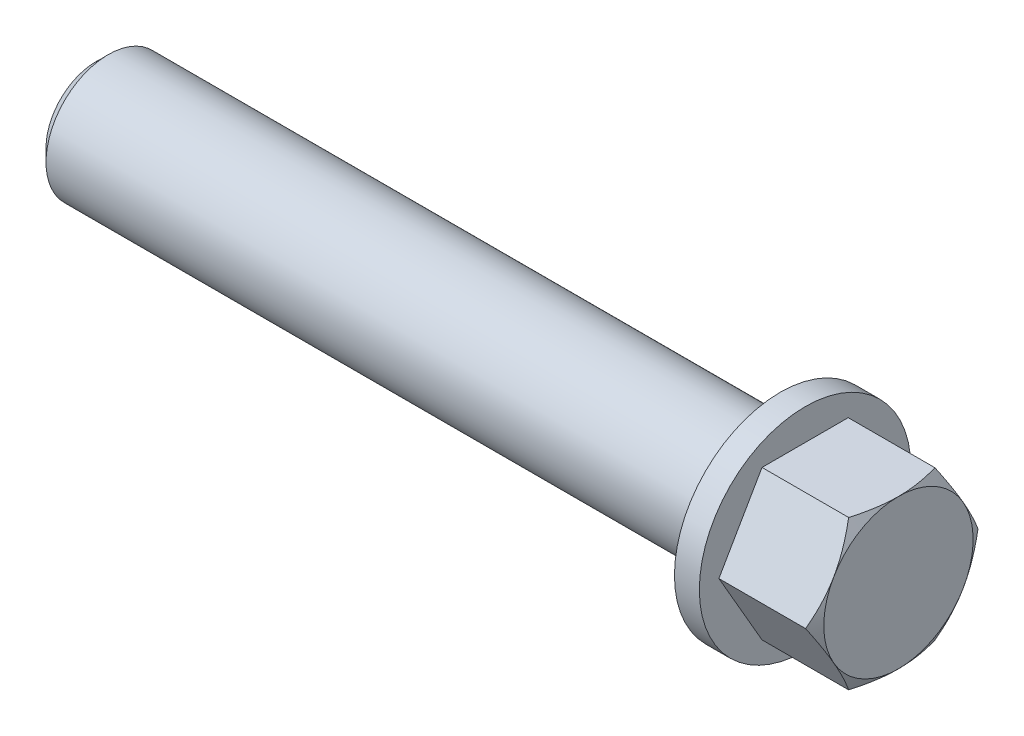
ISO-10303-21;
HEADER;
FILE_DESCRIPTION(('STEP AP214'),'2;1');
FILE_NAME('part.step','',(''),(''),'','','');
FILE_SCHEMA(('AUTOMOTIVE_DESIGN { 1 0 10303 214 1 1 1 1 }'));
ENDSEC;
DATA;
#1=APPLICATION_CONTEXT('core data for automotive mechanical design processes');
#2=APPLICATION_PROTOCOL_DEFINITION('international standard','automotive_design',2000,#1);
#3=PRODUCT_CONTEXT('',#1,'mechanical');
#4=PRODUCT('Part','Part','',(#3));
#5=PRODUCT_RELATED_PRODUCT_CATEGORY('part','',(#4));
#6=PRODUCT_DEFINITION_FORMATION('','',#4);
#7=PRODUCT_DEFINITION_CONTEXT('part definition',#1,'design');
#8=PRODUCT_DEFINITION('design','',#6,#7);
#9=PRODUCT_DEFINITION_SHAPE('','',#8);
#10=(LENGTH_UNIT() NAMED_UNIT(*) SI_UNIT(.MILLI.,.METRE.));
#11=(NAMED_UNIT(*) PLANE_ANGLE_UNIT() SI_UNIT($,.RADIAN.));
#12=(NAMED_UNIT(*) SI_UNIT($,.STERADIAN.) SOLID_ANGLE_UNIT());
#13=UNCERTAINTY_MEASURE_WITH_UNIT(LENGTH_MEASURE(1.E-05),#10,'distance_accuracy_value','');
#14=(GEOMETRIC_REPRESENTATION_CONTEXT(3) GLOBAL_UNCERTAINTY_ASSIGNED_CONTEXT((#13)) GLOBAL_UNIT_ASSIGNED_CONTEXT((#10,
#11,#12)) REPRESENTATION_CONTEXT('',''));
#15=CARTESIAN_POINT('',(0.,0.,0.));
#16=DIRECTION('',(0.,0.,1.));
#17=DIRECTION('',(1.,0.,0.));
#18=AXIS2_PLACEMENT_3D('',#15,#16,#17);
#19=CARTESIAN_POINT('',(7.5,-6.,-3.46410161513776));
#20=DIRECTION('',(0.,0.5,0.866025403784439));
#21=DIRECTION('',(0.,-0.866025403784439,0.5));
#22=AXIS2_PLACEMENT_3D('',#19,#20,#21);
#23=PLANE('',#22);
#24=DIRECTION('',(-1.,0.,0.));
#25=VECTOR('',#24,1.);
#26=CARTESIAN_POINT('',(7.5,0.,-6.92820323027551));
#27=LINE('',#26,#25);
#28=CARTESIAN_POINT('',(6.96410161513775,0.,-6.92820323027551));
#29=VERTEX_POINT('',#28);
#30=CARTESIAN_POINT('',(0.,0.,-6.92820323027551));
#31=VERTEX_POINT('',#30);
#32=EDGE_CURVE('E145',#29,#31,#27,.T.);
#33=ORIENTED_EDGE('',*,*,#32,.F.);
#34=CARTESIAN_POINT('',(6.96403494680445,0.0002,-6.92831870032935));
#35=CARTESIAN_POINT('',(7.00799100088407,-0.131687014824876,-6.85217369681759));
#36=CARTESIAN_POINT('',(7.0499521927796,-0.264065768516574,-6.7757447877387));
#37=CARTESIAN_POINT('',(7.12933542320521,-0.52989833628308,-6.62226628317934));
#38=CARTESIAN_POINT('',(7.16675550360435,-0.663352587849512,-6.54521643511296));
#39=CARTESIAN_POINT('',(7.27146958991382,-1.06585213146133,-6.31283321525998));
#40=CARTESIAN_POINT('',(7.33102994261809,-1.33648623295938,-6.15658254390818));
#41=CARTESIAN_POINT('',(7.40087178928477,-1.74148524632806,-5.92275625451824));
#42=CARTESIAN_POINT('',(7.42076777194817,-1.87464004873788,-5.84587929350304));
#43=CARTESIAN_POINT('',(7.45413058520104,-2.14155132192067,-5.69177799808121));
#44=CARTESIAN_POINT('',(7.46759798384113,-2.27530773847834,-5.6145536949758));
#45=CARTESIAN_POINT('',(7.48776040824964,-2.54305288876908,-5.45997096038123));
#46=CARTESIAN_POINT('',(7.49446312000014,-2.67704118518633,-5.38261278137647));
#47=CARTESIAN_POINT('',(7.50095963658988,-2.94513416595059,-5.22782922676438));
#48=CARTESIAN_POINT('',(7.50075365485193,-3.07923884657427,-5.1504038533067));
#49=CARTESIAN_POINT('',(7.49069281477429,-3.44664501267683,-4.93828180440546));
#50=CARTESIAN_POINT('',(7.47380210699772,-3.6798262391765,-4.80365456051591));
#51=CARTESIAN_POINT('',(7.42024077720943,-4.14463991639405,-4.53529425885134));
#52=CARTESIAN_POINT('',(7.38355184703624,-4.3762707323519,-4.40156214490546));
#53=CARTESIAN_POINT('',(7.2918398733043,-4.84201989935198,-4.13266173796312));
#54=CARTESIAN_POINT('',(7.23642824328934,-5.07607947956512,-3.99752737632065));
#55=CARTESIAN_POINT('',(7.11066608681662,-5.54070808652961,-3.7292739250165));
#56=CARTESIAN_POINT('',(7.04034510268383,-5.77128306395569,-3.59615139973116));
#57=CARTESIAN_POINT('',(6.96403494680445,-6.0002,-3.46398614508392));
#58=B_SPLINE_CURVE_WITH_KNOTS('',3,(#34,#35,#36,#37,#38,#39,#40,#41,#42,#43,#44,#45,#46,#47,#48,
#49,#50,#51,#52,#53,#54,#55,#56,#57),.UNSPECIFIED.,.F.,.F.,(4,2,2,2,2,2,2,2,2,2,2,4),(0.,
0.475482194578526,0.951168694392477,1.90451835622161,2.36951738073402,2.83447530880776,
3.29890435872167,3.76331906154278,4.57182194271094,5.38107376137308,6.20827406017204,
7.03385036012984),.UNSPECIFIED.);
#59=CARTESIAN_POINT('',(7.5,-3.,-5.19615242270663));
#60=VERTEX_POINT('',#59);
#61=EDGE_CURVE('E228',#29,#60,#58,.T.);
#62=ORIENTED_EDGE('',*,*,#61,.T.);
#63=CARTESIAN_POINT('',(6.96410161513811,-6.,-3.46410161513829));
#64=VERTEX_POINT('',#63);
#65=EDGE_CURVE('E230',#60,#64,#58,.T.);
#66=ORIENTED_EDGE('',*,*,#65,.T.);
#67=DIRECTION('',(-1.,0.,0.));
#68=VECTOR('',#67,1.);
#69=CARTESIAN_POINT('',(7.5,-6.,-3.46410161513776));
#70=LINE('',#69,#68);
#71=CARTESIAN_POINT('',(0.,-6.,-3.46410161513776));
#72=VERTEX_POINT('',#71);
#73=EDGE_CURVE('E117',#64,#72,#70,.T.);
#74=ORIENTED_EDGE('',*,*,#73,.T.);
#75=DIRECTION('',(0.,0.866025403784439,-0.5));
#76=VECTOR('',#75,1.);
#77=CARTESIAN_POINT('',(0.,-6.,-3.46410161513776));
#78=LINE('',#77,#76);
#79=EDGE_CURVE('E113',#72,#31,#78,.T.);
#80=ORIENTED_EDGE('',*,*,#79,.T.);
#81=EDGE_LOOP('',(#33,#62,#66,#74,#80));
#82=FACE_BOUND('',#81,.T.);
#83=ADVANCED_FACE('F36',(#82),#23,.F.);
#84=CARTESIAN_POINT('',(7.5,0.,-6.92820323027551));
#85=DIRECTION('',(0.,-0.5,0.866025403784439));
#86=DIRECTION('',(0.,-0.866025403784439,-0.5));
#87=AXIS2_PLACEMENT_3D('',#84,#85,#86);
#88=PLANE('',#87);
#89=DIRECTION('',(-1.,0.,0.));
#90=VECTOR('',#89,1.);
#91=CARTESIAN_POINT('',(7.5,6.,-3.46410161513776));
#92=LINE('',#91,#90);
#93=CARTESIAN_POINT('',(6.96410161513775,6.,-3.46410161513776));
#94=VERTEX_POINT('',#93);
#95=CARTESIAN_POINT('',(0.,6.,-3.46410161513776));
#96=VERTEX_POINT('',#95);
#97=EDGE_CURVE('E142',#94,#96,#92,.T.);
#98=ORIENTED_EDGE('',*,*,#97,.F.);
#99=CARTESIAN_POINT('',(6.96403494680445,6.0002,-3.46398614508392));
#100=CARTESIAN_POINT('',(7.00799100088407,5.86831298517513,-3.54013114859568));
#101=CARTESIAN_POINT('',(7.0499521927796,5.73593423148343,-3.61656005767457));
#102=CARTESIAN_POINT('',(7.12933542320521,5.47010166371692,-3.77003856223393));
#103=CARTESIAN_POINT('',(7.16675550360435,5.33664741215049,-3.84708841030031));
#104=CARTESIAN_POINT('',(7.27146958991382,4.93414786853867,-4.07947163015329));
#105=CARTESIAN_POINT('',(7.33102994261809,4.66351376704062,-4.23572230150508));
#106=CARTESIAN_POINT('',(7.40087178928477,4.25851475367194,-4.46954859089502));
#107=CARTESIAN_POINT('',(7.42076777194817,4.12535995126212,-4.54642555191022));
#108=CARTESIAN_POINT('',(7.45413058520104,3.85844867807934,-4.70052684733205));
#109=CARTESIAN_POINT('',(7.46759798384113,3.72469226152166,-4.77775115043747));
#110=CARTESIAN_POINT('',(7.48776040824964,3.45694711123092,-4.93233388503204));
#111=CARTESIAN_POINT('',(7.49446312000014,3.32295881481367,-5.0096920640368));
#112=CARTESIAN_POINT('',(7.50095963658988,3.05486583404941,-5.16447561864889));
#113=CARTESIAN_POINT('',(7.50075365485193,2.92076115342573,-5.24190099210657));
#114=CARTESIAN_POINT('',(7.49069281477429,2.55335498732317,-5.45402304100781));
#115=CARTESIAN_POINT('',(7.47380210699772,2.3201737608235,-5.58865028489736));
#116=CARTESIAN_POINT('',(7.42024077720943,1.85536008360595,-5.85701058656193));
#117=CARTESIAN_POINT('',(7.38355184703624,1.6237292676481,-5.99074270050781));
#118=CARTESIAN_POINT('',(7.2918398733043,1.15798010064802,-6.25964310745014));
#119=CARTESIAN_POINT('',(7.23642824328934,0.923920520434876,-6.39477746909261));
#120=CARTESIAN_POINT('',(7.11066608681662,0.45929191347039,-6.66303092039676));
#121=CARTESIAN_POINT('',(7.04034510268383,0.228716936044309,-6.7961534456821));
#122=CARTESIAN_POINT('',(6.96403494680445,-0.0001999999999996,-6.92831870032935));
#123=B_SPLINE_CURVE_WITH_KNOTS('',3,(#99,#100,#101,#102,#103,#104,#105,#106,#107,#108,#109,#110,
#111,#112,#113,#114,#115,#116,#117,#118,#119,#120,#121,#122),.UNSPECIFIED.,.F.,.F.,(4,2,2,2,2,2,
2,2,2,2,2,4),(0.,0.475482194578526,0.951168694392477,1.90451835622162,2.36951738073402,
2.83447530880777,3.29890435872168,3.76331906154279,4.57182194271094,5.38107376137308,
6.20827406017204,7.03385036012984),.UNSPECIFIED.);
#124=CARTESIAN_POINT('',(7.5,3.,-5.19615242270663));
#125=VERTEX_POINT('',#124);
#126=EDGE_CURVE('E219',#94,#125,#123,.T.);
#127=ORIENTED_EDGE('',*,*,#126,.T.);
#128=EDGE_CURVE('E193',#125,#29,#123,.T.);
#129=ORIENTED_EDGE('',*,*,#128,.T.);
#130=ORIENTED_EDGE('',*,*,#32,.T.);
#131=DIRECTION('',(0.,0.866025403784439,0.5));
#132=VECTOR('',#131,1.);
#133=CARTESIAN_POINT('',(0.,0.,-6.92820323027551));
#134=LINE('',#133,#132);
#135=EDGE_CURVE('E184',#31,#96,#134,.T.);
#136=ORIENTED_EDGE('',*,*,#135,.T.);
#137=EDGE_LOOP('',(#98,#127,#129,#130,#136));
#138=FACE_BOUND('',#137,.T.);
#139=ADVANCED_FACE('F207',(#138),#88,.F.);
#140=CARTESIAN_POINT('',(7.5,6.,-3.46410161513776));
#141=DIRECTION('',(0.,-1.,0.));
#142=DIRECTION('',(0.,0.,-1.));
#143=AXIS2_PLACEMENT_3D('',#140,#141,#142);
#144=PLANE('',#143);
#145=DIRECTION('',(-1.,0.,0.));
#146=VECTOR('',#145,1.);
#147=CARTESIAN_POINT('',(7.5,6.,3.46410161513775));
#148=LINE('',#147,#146);
#149=CARTESIAN_POINT('',(6.96410161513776,6.,3.46410161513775));
#150=VERTEX_POINT('',#149);
#151=CARTESIAN_POINT('',(0.,6.,3.46410161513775));
#152=VERTEX_POINT('',#151);
#153=EDGE_CURVE('E139',#150,#152,#148,.T.);
#154=ORIENTED_EDGE('',*,*,#153,.F.);
#155=CARTESIAN_POINT('',(4.53815459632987,6.00000000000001,-9.37434719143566));
#156=CARTESIAN_POINT('',(4.66588950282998,6.,-9.11159664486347));
#157=CARTESIAN_POINT('',(4.79241913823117,6.,-8.84825012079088));
#158=CARTESIAN_POINT('',(5.04239100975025,6.,-8.32004824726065));
#159=CARTESIAN_POINT('',(5.16583277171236,6.,-8.05519267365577));
#160=CARTESIAN_POINT('',(5.4095577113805,6.,-7.52232548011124));
#161=CARTESIAN_POINT('',(5.52982064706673,6.,-7.25430457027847));
#162=CARTESIAN_POINT('',(5.7655135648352,6.,-6.71615392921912));
#163=CARTESIAN_POINT('',(5.88094377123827,6.,-6.44602429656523));
#164=CARTESIAN_POINT('',(6.10932867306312,6.,-5.89445558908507));
#165=CARTESIAN_POINT('',(6.22208293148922,6.,-5.61293307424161));
#166=CARTESIAN_POINT('',(6.43922432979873,6.,-5.04662051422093));
#167=CARTESIAN_POINT('',(6.5436105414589,6.,-4.76183011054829));
#168=CARTESIAN_POINT('',(6.7413280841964,6.,-4.18903963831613));
#169=CARTESIAN_POINT('',(6.83468115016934,6.,-3.90104714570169));
#170=CARTESIAN_POINT('',(7.00738274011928,6.,-3.32092961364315));
#171=CARTESIAN_POINT('',(7.08673559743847,6.,-3.02880588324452));
#172=CARTESIAN_POINT('',(7.22727999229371,6.,-2.44180312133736));
#173=CARTESIAN_POINT('',(7.2885662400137,6.,-2.14694713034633));
#174=CARTESIAN_POINT('',(7.38951072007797,6.,-1.55345729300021));
#175=CARTESIAN_POINT('',(7.42917131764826,6.,-1.2548238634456));
#176=CARTESIAN_POINT('',(7.46981310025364,6.,-0.807215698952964));
#177=CARTESIAN_POINT('',(7.48021070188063,6.,-0.659059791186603));
#178=CARTESIAN_POINT('',(7.49473309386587,6.,-0.36243435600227));
#179=CARTESIAN_POINT('',(7.49885799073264,6.,-0.213964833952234));
#180=CARTESIAN_POINT('',(7.50072952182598,6.,0.0830171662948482));
#181=CARTESIAN_POINT('',(7.49847601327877,6.,0.23152964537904));
#182=CARTESIAN_POINT('',(7.48764825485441,6.,0.528326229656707));
#183=CARTESIAN_POINT('',(7.47907370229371,6.,0.676610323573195));
#184=CARTESIAN_POINT('',(7.4512311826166,6.,1.0307338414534));
#185=CARTESIAN_POINT('',(7.42908921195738,6.,1.23635220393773));
#186=CARTESIAN_POINT('',(7.37384140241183,6.,1.64609980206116));
#187=CARTESIAN_POINT('',(7.34073414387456,6.,1.85022884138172));
#188=CARTESIAN_POINT('',(7.22671763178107,6.,2.46011094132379));
#189=CARTESIAN_POINT('',(7.13113151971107,6.,2.8631585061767));
#190=CARTESIAN_POINT('',(6.96482537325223,6.,3.46624827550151));
#191=CARTESIAN_POINT('',(6.90472502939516,6.,3.66939855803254));
#192=CARTESIAN_POINT('',(6.77815690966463,6.,4.07372546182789));
#193=CARTESIAN_POINT('',(6.71168908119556,5.99999999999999,4.27490206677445));
#194=CARTESIAN_POINT('',(6.57346306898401,5.99999999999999,4.6753490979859));
#195=CARTESIAN_POINT('',(6.50170638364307,5.99999999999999,4.87462004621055));
#196=CARTESIAN_POINT('',(6.35375957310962,5.99999999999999,5.27149669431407));
#197=CARTESIAN_POINT('',(6.2775695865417,5.99999999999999,5.4691024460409));
#198=CARTESIAN_POINT('',(6.04601415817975,5.99999999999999,6.0532941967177));
#199=CARTESIAN_POINT('',(5.88535342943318,5.99999999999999,6.43778007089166));
#200=CARTESIAN_POINT('',(5.5539041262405,5.99999999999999,7.20237916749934));
#201=CARTESIAN_POINT('',(5.38311401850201,5.99999999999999,7.58249171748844));
#202=CARTESIAN_POINT('',(5.03408337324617,5.99999999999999,8.33949830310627));
#203=CARTESIAN_POINT('',(4.85583916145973,5.99999999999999,8.71639063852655));
#204=CARTESIAN_POINT('',(4.49388903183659,5.99999999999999,9.46750615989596));
#205=CARTESIAN_POINT('',(4.31018343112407,5.99999999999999,9.84172949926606));
#206=CARTESIAN_POINT('',(3.93826406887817,5.99999999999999,10.5888150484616));
#207=CARTESIAN_POINT('',(3.7500423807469,5.99999999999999,10.9616733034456));
#208=CARTESIAN_POINT('',(3.3703714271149,5.99999999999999,11.7057456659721));
#209=CARTESIAN_POINT('',(3.17892212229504,5.99999999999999,12.0769597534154));
#210=CARTESIAN_POINT('',(2.79354033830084,5.99999999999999,12.8179592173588));
#211=CARTESIAN_POINT('',(2.59960859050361,5.99999999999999,13.1877449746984));
#212=CARTESIAN_POINT('',(2.20971236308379,5.99999999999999,13.9262438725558));
#213=CARTESIAN_POINT('',(2.01374787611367,5.99999999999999,14.2949570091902));
#214=CARTESIAN_POINT('',(1.4714953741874,5.99999999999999,15.3097665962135));
#215=CARTESIAN_POINT('',(1.12350140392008,5.99999999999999,15.9549512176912));
#216=CARTESIAN_POINT('',(0.423895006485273,5.99999999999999,17.2434201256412));
#217=CARTESIAN_POINT('',(0.0722822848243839,5.99999999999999,17.8867042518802));
#218=CARTESIAN_POINT('',(-0.63227161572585,5.99999999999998,19.1694209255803));
#219=CARTESIAN_POINT('',(-0.985202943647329,5.99999999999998,19.8088588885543));
#220=CARTESIAN_POINT('',(-1.69305970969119,5.99999999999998,21.0865502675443));
#221=CARTESIAN_POINT('',(-2.04798495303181,5.99999999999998,21.7248037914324));
#222=CARTESIAN_POINT('',(-2.40362541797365,5.99999999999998,22.3626558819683));
#223=B_SPLINE_CURVE_WITH_KNOTS('',3,(#155,#156,#157,#158,#159,#160,#161,#162,#163,#164,#165,
#166,#167,#168,#169,#170,#171,#172,#173,#174,#175,#176,#177,#178,#179,#180,#181,#182,#183,#184,
#185,#186,#187,#188,#189,#190,#191,#192,#193,#194,#195,#196,#197,#198,#199,#200,#201,#202,#203,
#204,#205,#206,#207,#208,#209,#210,#211,#212,#213,#214,#215,#216,#217,#218,#219,#220,#221,#222),
.UNSPECIFIED.,.F.,.F.,(4,2,2,2,2,2,2,2,2,2,2,2,2,2,2,2,2,2,2,2,2,2,2,2,2,2,2,2,2,2,2,2,2,4),(0.,
0.876472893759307,1.75307955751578,2.63433891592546,3.51555732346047,4.42524359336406,
5.33503063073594,6.24299444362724,7.15067672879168,8.05351243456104,8.95624937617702,
9.40169771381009,9.84713848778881,10.292589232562,10.7380613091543,11.3581343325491,
11.9782876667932,13.2191954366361,13.8547020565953,14.4902139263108,15.1255464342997,
15.7608590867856,17.0107329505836,18.260796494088,19.5114836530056,20.7620983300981,
22.0150971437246,23.2681112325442,24.5207642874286,25.7734218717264,27.9725551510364,
30.1718688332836,32.3629769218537,34.5538745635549),.UNSPECIFIED.);
#224=CARTESIAN_POINT('',(7.5,6.,0.));
#225=VERTEX_POINT('',#224);
#226=EDGE_CURVE('E176',#150,#225,#223,.F.);
#227=ORIENTED_EDGE('',*,*,#226,.T.);
#228=EDGE_CURVE('E178',#225,#94,#223,.F.);
#229=ORIENTED_EDGE('',*,*,#228,.T.);
#230=ORIENTED_EDGE('',*,*,#97,.T.);
#231=DIRECTION('',(0.,0.,1.));
#232=VECTOR('',#231,1.);
#233=CARTESIAN_POINT('',(0.,6.,-3.46410161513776));
#234=LINE('',#233,#232);
#235=EDGE_CURVE('E133',#96,#152,#234,.T.);
#236=ORIENTED_EDGE('',*,*,#235,.T.);
#237=EDGE_LOOP('',(#154,#227,#229,#230,#236));
#238=FACE_BOUND('',#237,.T.);
#239=ADVANCED_FACE('F177',(#238),#144,.F.);
#240=CARTESIAN_POINT('',(7.5,6.,3.46410161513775));
#241=DIRECTION('',(0.,-0.5,-0.866025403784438));
#242=DIRECTION('',(0.,0.866025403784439,-0.5));
#243=AXIS2_PLACEMENT_3D('',#240,#241,#242);
#244=PLANE('',#243);
#245=DIRECTION('',(-1.,0.,0.));
#246=VECTOR('',#245,1.);
#247=CARTESIAN_POINT('',(7.5,0.,6.92820323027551));
#248=LINE('',#247,#246);
#249=CARTESIAN_POINT('',(6.96410161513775,0.,6.92820323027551));
#250=VERTEX_POINT('',#249);
#251=CARTESIAN_POINT('',(0.,0.,6.92820323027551));
#252=VERTEX_POINT('',#251);
#253=EDGE_CURVE('E125',#250,#252,#248,.T.);
#254=ORIENTED_EDGE('',*,*,#253,.F.);
#255=CARTESIAN_POINT('',(6.96403494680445,-0.000200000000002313,6.92831870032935));
#256=CARTESIAN_POINT('',(7.00799100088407,0.131687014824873,6.85217369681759));
#257=CARTESIAN_POINT('',(7.0499521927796,0.264065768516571,6.7757447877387));
#258=CARTESIAN_POINT('',(7.12933542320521,0.529898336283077,6.62226628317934));
#259=CARTESIAN_POINT('',(7.16675550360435,0.663352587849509,6.54521643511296));
#260=CARTESIAN_POINT('',(7.27146958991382,1.06585213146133,6.31283321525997));
#261=CARTESIAN_POINT('',(7.3310299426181,1.33648623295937,6.15658254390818));
#262=CARTESIAN_POINT('',(7.40087178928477,1.74148524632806,5.92275625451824));
#263=CARTESIAN_POINT('',(7.42076777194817,1.87464004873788,5.84587929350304));
#264=CARTESIAN_POINT('',(7.45413058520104,2.14155132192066,5.69177799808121));
#265=CARTESIAN_POINT('',(7.46759798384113,2.27530773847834,5.6145536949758));
#266=CARTESIAN_POINT('',(7.48776040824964,2.54305288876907,5.45997096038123));
#267=CARTESIAN_POINT('',(7.49446312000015,2.67704118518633,5.38261278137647));
#268=CARTESIAN_POINT('',(7.50095963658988,2.94513416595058,5.22782922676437));
#269=CARTESIAN_POINT('',(7.50075365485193,3.07923884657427,5.1504038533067));
#270=CARTESIAN_POINT('',(7.49069281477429,3.44664501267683,4.93828180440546));
#271=CARTESIAN_POINT('',(7.47380210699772,3.6798262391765,4.80365456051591));
#272=CARTESIAN_POINT('',(7.42024077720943,4.14463991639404,4.53529425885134));
#273=CARTESIAN_POINT('',(7.38355184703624,4.3762707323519,4.40156214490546));
#274=CARTESIAN_POINT('',(7.2918398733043,4.84201989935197,4.13266173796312));
#275=CARTESIAN_POINT('',(7.23642824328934,5.07607947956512,3.99752737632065));
#276=CARTESIAN_POINT('',(7.11066608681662,5.54070808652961,3.7292739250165));
#277=CARTESIAN_POINT('',(7.04034510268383,5.77128306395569,3.59615139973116));
#278=CARTESIAN_POINT('',(6.96403494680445,6.0002,3.46398614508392));
#279=B_SPLINE_CURVE_WITH_KNOTS('',3,(#255,#256,#257,#258,#259,#260,#261,#262,#263,#264,#265,
#266,#267,#268,#269,#270,#271,#272,#273,#274,#275,#276,#277,#278),.UNSPECIFIED.,.F.,.F.,(4,2,2,
2,2,2,2,2,2,2,2,4),(0.,0.475482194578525,0.951168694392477,1.90451835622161,2.36951738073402,
2.83447530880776,3.29890435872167,3.76331906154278,4.57182194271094,5.38107376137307,
6.20827406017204,7.03385036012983),.UNSPECIFIED.);
#280=CARTESIAN_POINT('',(7.5,3.,5.19615242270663));
#281=VERTEX_POINT('',#280);
#282=EDGE_CURVE('E221',#250,#281,#279,.T.);
#283=ORIENTED_EDGE('',*,*,#282,.T.);
#284=EDGE_CURVE('E186',#281,#150,#279,.T.);
#285=ORIENTED_EDGE('',*,*,#284,.T.);
#286=ORIENTED_EDGE('',*,*,#153,.T.);
#287=DIRECTION('',(0.,-0.866025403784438,0.5));
#288=VECTOR('',#287,1.);
#289=CARTESIAN_POINT('',(0.,6.,3.46410161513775));
#290=LINE('',#289,#288);
#291=EDGE_CURVE('E131',#152,#252,#290,.T.);
#292=ORIENTED_EDGE('',*,*,#291,.T.);
#293=EDGE_LOOP('',(#254,#283,#285,#286,#292));
#294=FACE_BOUND('',#293,.T.);
#295=ADVANCED_FACE('F206',(#294),#244,.F.);
#296=CARTESIAN_POINT('',(7.5,0.,6.92820323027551));
#297=DIRECTION('',(0.,0.5,-0.866025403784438));
#298=DIRECTION('',(0.,0.866025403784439,0.5));
#299=AXIS2_PLACEMENT_3D('',#296,#297,#298);
#300=PLANE('',#299);
#301=DIRECTION('',(-1.,0.,0.));
#302=VECTOR('',#301,1.);
#303=CARTESIAN_POINT('',(7.5,-6.,3.46410161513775));
#304=LINE('',#303,#302);
#305=CARTESIAN_POINT('',(6.96410161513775,-6.,3.46410161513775));
#306=VERTEX_POINT('',#305);
#307=CARTESIAN_POINT('',(0.,-6.,3.46410161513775));
#308=VERTEX_POINT('',#307);
#309=EDGE_CURVE('E120',#306,#308,#304,.T.);
#310=ORIENTED_EDGE('',*,*,#309,.F.);
#311=CARTESIAN_POINT('',(6.96403494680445,-6.0002,3.46398614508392));
#312=CARTESIAN_POINT('',(7.00799100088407,-5.86831298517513,3.54013114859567));
#313=CARTESIAN_POINT('',(7.0499521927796,-5.73593423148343,3.61656005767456));
#314=CARTESIAN_POINT('',(7.12933542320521,-5.47010166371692,3.77003856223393));
#315=CARTESIAN_POINT('',(7.16675550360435,-5.33664741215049,3.8470884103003));
#316=CARTESIAN_POINT('',(7.27146958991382,-4.93414786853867,4.07947163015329));
#317=CARTESIAN_POINT('',(7.33102994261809,-4.66351376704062,4.23572230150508));
#318=CARTESIAN_POINT('',(7.40087178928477,-4.25851475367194,4.46954859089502));
#319=CARTESIAN_POINT('',(7.42076777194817,-4.12535995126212,4.54642555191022));
#320=CARTESIAN_POINT('',(7.45413058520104,-3.85844867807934,4.70052684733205));
#321=CARTESIAN_POINT('',(7.46759798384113,-3.72469226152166,4.77775115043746));
#322=CARTESIAN_POINT('',(7.48776040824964,-3.45694711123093,4.93233388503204));
#323=CARTESIAN_POINT('',(7.49446312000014,-3.32295881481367,5.0096920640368));
#324=CARTESIAN_POINT('',(7.50095963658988,-3.05486583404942,5.16447561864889));
#325=CARTESIAN_POINT('',(7.50075365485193,-2.92076115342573,5.24190099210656));
#326=CARTESIAN_POINT('',(7.49069281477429,-2.55335498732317,5.4540230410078));
#327=CARTESIAN_POINT('',(7.47380210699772,-2.3201737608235,5.58865028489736));
#328=CARTESIAN_POINT('',(7.42024077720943,-1.85536008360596,5.85701058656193));
#329=CARTESIAN_POINT('',(7.38355184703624,-1.6237292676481,5.99074270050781));
#330=CARTESIAN_POINT('',(7.2918398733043,-1.15798010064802,6.25964310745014));
#331=CARTESIAN_POINT('',(7.23642824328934,-0.923920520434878,6.39477746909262));
#332=CARTESIAN_POINT('',(7.11066608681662,-0.459291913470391,6.66303092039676));
#333=CARTESIAN_POINT('',(7.04034510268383,-0.228716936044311,6.7961534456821));
#334=CARTESIAN_POINT('',(6.96403494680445,0.000199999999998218,6.92831870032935));
#335=B_SPLINE_CURVE_WITH_KNOTS('',3,(#311,#312,#313,#314,#315,#316,#317,#318,#319,#320,#321,
#322,#323,#324,#325,#326,#327,#328,#329,#330,#331,#332,#333,#334),.UNSPECIFIED.,.F.,.F.,(4,2,2,
2,2,2,2,2,2,2,2,4),(0.,0.475482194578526,0.951168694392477,1.90451835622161,2.36951738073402,
2.83447530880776,3.29890435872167,3.76331906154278,4.57182194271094,5.38107376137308,
6.20827406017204,7.03385036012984),.UNSPECIFIED.);
#336=CARTESIAN_POINT('',(7.5,-3.,5.19615242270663));
#337=VERTEX_POINT('',#336);
#338=EDGE_CURVE('E56',#306,#337,#335,.T.);
#339=ORIENTED_EDGE('',*,*,#338,.T.);
#340=EDGE_CURVE('E227',#337,#250,#335,.T.);
#341=ORIENTED_EDGE('',*,*,#340,.T.);
#342=ORIENTED_EDGE('',*,*,#253,.T.);
#343=DIRECTION('',(0.,-0.866025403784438,-0.5));
#344=VECTOR('',#343,1.);
#345=CARTESIAN_POINT('',(0.,0.,6.92820323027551));
#346=LINE('',#345,#344);
#347=EDGE_CURVE('E110',#252,#308,#346,.T.);
#348=ORIENTED_EDGE('',*,*,#347,.T.);
#349=EDGE_LOOP('',(#310,#339,#341,#342,#348));
#350=FACE_BOUND('',#349,.T.);
#351=ADVANCED_FACE('F127',(#350),#300,.F.);
#352=CARTESIAN_POINT('',(7.5,-6.,3.46410161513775));
#353=DIRECTION('',(0.,1.,0.));
#354=DIRECTION('',(0.,0.,1.));
#355=AXIS2_PLACEMENT_3D('',#352,#353,#354);
#356=PLANE('',#355);
#357=ORIENTED_EDGE('',*,*,#73,.F.);
#358=CARTESIAN_POINT('',(4.53815459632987,-6.,-9.37434719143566));
#359=CARTESIAN_POINT('',(4.66588950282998,-6.,-9.11159664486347));
#360=CARTESIAN_POINT('',(4.79241913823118,-6.,-8.84825012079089));
#361=CARTESIAN_POINT('',(5.04239100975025,-6.,-8.32004824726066));
#362=CARTESIAN_POINT('',(5.16583277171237,-6.,-8.05519267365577));
#363=CARTESIAN_POINT('',(5.4095577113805,-6.,-7.52232548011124));
#364=CARTESIAN_POINT('',(5.52982064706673,-6.,-7.25430457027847));
#365=CARTESIAN_POINT('',(5.7655135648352,-6.,-6.71615392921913));
#366=CARTESIAN_POINT('',(5.88094377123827,-6.,-6.44602429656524));
#367=CARTESIAN_POINT('',(6.10932867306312,-6.,-5.89445558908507));
#368=CARTESIAN_POINT('',(6.22208293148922,-6.,-5.61293307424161));
#369=CARTESIAN_POINT('',(6.43922432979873,-6.,-5.04662051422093));
#370=CARTESIAN_POINT('',(6.5436105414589,-6.,-4.76183011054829));
#371=CARTESIAN_POINT('',(6.7413280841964,-6.,-4.18903963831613));
#372=CARTESIAN_POINT('',(6.83468115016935,-6.,-3.90104714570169));
#373=CARTESIAN_POINT('',(7.00738274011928,-6.,-3.32092961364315));
#374=CARTESIAN_POINT('',(7.08673559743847,-6.,-3.02880588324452));
#375=CARTESIAN_POINT('',(7.22727999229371,-6.,-2.44180312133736));
#376=CARTESIAN_POINT('',(7.2885662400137,-6.,-2.14694713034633));
#377=CARTESIAN_POINT('',(7.38951072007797,-6.,-1.55345729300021));
#378=CARTESIAN_POINT('',(7.42917131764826,-6.,-1.2548238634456));
#379=CARTESIAN_POINT('',(7.46981310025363,-6.,-0.807215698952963));
#380=CARTESIAN_POINT('',(7.48021070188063,-6.,-0.659059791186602));
#381=CARTESIAN_POINT('',(7.49473309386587,-6.,-0.362434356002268));
#382=CARTESIAN_POINT('',(7.49885799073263,-6.,-0.213964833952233));
#383=CARTESIAN_POINT('',(7.50072952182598,-6.,0.0830171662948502));
#384=CARTESIAN_POINT('',(7.49847601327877,-6.,0.231529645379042));
#385=CARTESIAN_POINT('',(7.48764825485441,-6.,0.528326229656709));
#386=CARTESIAN_POINT('',(7.47907370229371,-6.,0.676610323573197));
#387=CARTESIAN_POINT('',(7.45123118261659,-6.,1.03073384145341));
#388=CARTESIAN_POINT('',(7.42908921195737,-6.,1.23635220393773));
#389=CARTESIAN_POINT('',(7.37384140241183,-6.,1.64609980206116));
#390=CARTESIAN_POINT('',(7.34073414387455,-6.,1.85022884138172));
#391=CARTESIAN_POINT('',(7.22671763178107,-6.,2.46011094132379));
#392=CARTESIAN_POINT('',(7.13113151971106,-6.,2.8631585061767));
#393=CARTESIAN_POINT('',(6.96482537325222,-6.,3.46624827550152));
#394=CARTESIAN_POINT('',(6.90472502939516,-6.,3.66939855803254));
#395=CARTESIAN_POINT('',(6.77815690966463,-6.,4.07372546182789));
#396=CARTESIAN_POINT('',(6.71168908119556,-6.,4.27490206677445));
#397=CARTESIAN_POINT('',(6.573463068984,-6.,4.67534909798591));
#398=CARTESIAN_POINT('',(6.50170638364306,-6.,4.87462004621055));
#399=CARTESIAN_POINT('',(6.35375957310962,-6.,5.27149669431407));
#400=CARTESIAN_POINT('',(6.2775695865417,-6.,5.4691024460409));
#401=CARTESIAN_POINT('',(6.04601415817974,-6.,6.0532941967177));
#402=CARTESIAN_POINT('',(5.88535342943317,-6.,6.43778007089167));
#403=CARTESIAN_POINT('',(5.55390412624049,-6.,7.20237916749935));
#404=CARTESIAN_POINT('',(5.383114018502,-6.,7.58249171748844));
#405=CARTESIAN_POINT('',(5.03408337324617,-6.,8.33949830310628));
#406=CARTESIAN_POINT('',(4.85583916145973,-6.,8.71639063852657));
#407=CARTESIAN_POINT('',(4.49388903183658,-6.,9.46750615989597));
#408=CARTESIAN_POINT('',(4.31018343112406,-6.,9.84172949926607));
#409=CARTESIAN_POINT('',(3.93826406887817,-6.,10.5888150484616));
#410=CARTESIAN_POINT('',(3.7500423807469,-6.,10.9616733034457));
#411=CARTESIAN_POINT('',(3.37037142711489,-6.,11.7057456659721));
#412=CARTESIAN_POINT('',(3.17892212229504,-6.,12.0769597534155));
#413=CARTESIAN_POINT('',(2.79354033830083,-6.,12.8179592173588));
#414=CARTESIAN_POINT('',(2.5996085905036,-6.,13.1877449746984));
#415=CARTESIAN_POINT('',(2.20971236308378,-6.,13.9262438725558));
#416=CARTESIAN_POINT('',(2.01374787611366,-6.,14.2949570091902));
#417=CARTESIAN_POINT('',(1.4714953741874,-6.,15.3097665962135));
#418=CARTESIAN_POINT('',(1.12350140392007,-6.,15.9549512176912));
#419=CARTESIAN_POINT('',(0.423895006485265,-6.,17.2434201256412));
#420=CARTESIAN_POINT('',(0.0722822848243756,-6.,17.8867042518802));
#421=CARTESIAN_POINT('',(-0.632271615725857,-6.,19.1694209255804));
#422=CARTESIAN_POINT('',(-0.985202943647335,-6.,19.8088588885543));
#423=CARTESIAN_POINT('',(-1.69305970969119,-6.,21.0865502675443));
#424=CARTESIAN_POINT('',(-2.04798495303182,-6.,21.7248037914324));
#425=CARTESIAN_POINT('',(-2.40362541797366,-6.,22.3626558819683));
#426=B_SPLINE_CURVE_WITH_KNOTS('',3,(#358,#359,#360,#361,#362,#363,#364,#365,#366,#367,#368,
#369,#370,#371,#372,#373,#374,#375,#376,#377,#378,#379,#380,#381,#382,#383,#384,#385,#386,#387,
#388,#389,#390,#391,#392,#393,#394,#395,#396,#397,#398,#399,#400,#401,#402,#403,#404,#405,#406,
#407,#408,#409,#410,#411,#412,#413,#414,#415,#416,#417,#418,#419,#420,#421,#422,#423,#424,#425),
.UNSPECIFIED.,.F.,.F.,(4,2,2,2,2,2,2,2,2,2,2,2,2,2,2,2,2,2,2,2,2,2,2,2,2,2,2,2,2,2,2,2,2,4),(0.,
0.876472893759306,1.75307955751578,2.63433891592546,3.51555732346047,4.42524359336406,
5.33503063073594,6.24299444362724,7.15067672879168,8.05351243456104,8.95624937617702,
9.4016977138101,9.84713848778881,10.292589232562,10.7380613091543,11.3581343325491,
11.9782876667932,13.2191954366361,13.8547020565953,14.4902139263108,15.1255464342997,
15.7608590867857,17.0107329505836,18.260796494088,19.5114836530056,20.7620983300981,
22.0150971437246,23.2681112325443,24.5207642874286,25.7734218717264,27.9725551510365,
30.1718688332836,32.3629769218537,34.5538745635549),.UNSPECIFIED.);
#427=CARTESIAN_POINT('',(7.5,-6.,0.));
#428=VERTEX_POINT('',#427);
#429=EDGE_CURVE('E235',#64,#428,#426,.T.);
#430=ORIENTED_EDGE('',*,*,#429,.T.);
#431=EDGE_CURVE('E123',#428,#306,#426,.T.);
#432=ORIENTED_EDGE('',*,*,#431,.T.);
#433=ORIENTED_EDGE('',*,*,#309,.T.);
#434=DIRECTION('',(0.,0.,-1.));
#435=VECTOR('',#434,1.);
#436=CARTESIAN_POINT('',(0.,-6.,3.46410161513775));
#437=LINE('',#436,#435);
#438=EDGE_CURVE('E106',#308,#72,#437,.T.);
#439=ORIENTED_EDGE('',*,*,#438,.T.);
#440=EDGE_LOOP('',(#357,#430,#432,#433,#439));
#441=FACE_BOUND('',#440,.T.);
#442=ADVANCED_FACE('F121',(#441),#356,.F.);
#443=CARTESIAN_POINT('',(7.5,0.,0.));
#444=DIRECTION('',(-1.,0.,0.));
#445=DIRECTION('',(0.,0.,1.));
#446=AXIS2_PLACEMENT_3D('',#443,#444,#445);
#447=CONICAL_SURFACE('',#446,6.,1.0471975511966);
#448=ORIENTED_EDGE('',*,*,#340,.F.);
#449=CARTESIAN_POINT('',(7.5,0.,0.));
#450=DIRECTION('',(-1.,0.,0.));
#451=DIRECTION('',(0.,0.,1.));
#452=AXIS2_PLACEMENT_3D('',#449,#450,#451);
#453=CIRCLE('',#452,6.);
#454=EDGE_CURVE('E148',#281,#337,#453,.F.);
#455=ORIENTED_EDGE('',*,*,#454,.F.);
#456=ORIENTED_EDGE('',*,*,#282,.F.);
#457=EDGE_LOOP('',(#448,#455,#456));
#458=FACE_BOUND('',#457,.T.);
#459=ADVANCED_FACE('F246',(#458),#447,.T.);
#460=ORIENTED_EDGE('',*,*,#284,.F.);
#461=CARTESIAN_POINT('',(7.5,0.,0.));
#462=DIRECTION('',(-1.,0.,0.));
#463=DIRECTION('',(0.,0.,1.));
#464=AXIS2_PLACEMENT_3D('',#461,#462,#463);
#465=CIRCLE('',#464,6.);
#466=EDGE_CURVE('E170',#281,#225,#465,.T.);
#467=ORIENTED_EDGE('',*,*,#466,.T.);
#468=ORIENTED_EDGE('',*,*,#226,.F.);
#469=EDGE_LOOP('',(#460,#467,#468));
#470=FACE_BOUND('',#469,.T.);
#471=ADVANCED_FACE('F199',(#470),#447,.T.);
#472=EDGE_CURVE('E151',#125,#225,#453,.F.);
#473=ORIENTED_EDGE('',*,*,#472,.F.);
#474=ORIENTED_EDGE('',*,*,#126,.F.);
#475=ORIENTED_EDGE('',*,*,#228,.F.);
#476=EDGE_LOOP('',(#473,#474,#475));
#477=FACE_BOUND('',#476,.T.);
#478=ADVANCED_FACE('F328',(#477),#447,.T.);
#479=EDGE_CURVE('E158',#60,#125,#453,.F.);
#480=ORIENTED_EDGE('',*,*,#479,.F.);
#481=ORIENTED_EDGE('',*,*,#61,.F.);
#482=ORIENTED_EDGE('',*,*,#128,.F.);
#483=EDGE_LOOP('',(#480,#481,#482));
#484=FACE_BOUND('',#483,.T.);
#485=ADVANCED_FACE('F319',(#484),#447,.T.);
#486=EDGE_CURVE('E155',#428,#60,#453,.F.);
#487=ORIENTED_EDGE('',*,*,#486,.F.);
#488=ORIENTED_EDGE('',*,*,#429,.F.);
#489=ORIENTED_EDGE('',*,*,#65,.F.);
#490=EDGE_LOOP('',(#487,#488,#489));
#491=FACE_BOUND('',#490,.T.);
#492=ADVANCED_FACE('F311',(#491),#447,.T.);
#493=ORIENTED_EDGE('',*,*,#431,.F.);
#494=EDGE_CURVE('E52',#337,#428,#453,.F.);
#495=ORIENTED_EDGE('',*,*,#494,.F.);
#496=ORIENTED_EDGE('',*,*,#338,.F.);
#497=EDGE_LOOP('',(#493,#495,#496));
#498=FACE_BOUND('',#497,.T.);
#499=ADVANCED_FACE('F302',(#498),#447,.T.);
#500=CARTESIAN_POINT('',(7.5,-6.,-3.46410161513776));
#501=DIRECTION('',(-1.,0.,0.));
#502=DIRECTION('',(0.,0.,1.));
#503=AXIS2_PLACEMENT_3D('',#500,#501,#502);
#504=PLANE('',#503);
#505=ORIENTED_EDGE('',*,*,#454,.T.);
#506=ORIENTED_EDGE('',*,*,#494,.T.);
#507=ORIENTED_EDGE('',*,*,#486,.T.);
#508=ORIENTED_EDGE('',*,*,#479,.T.);
#509=ORIENTED_EDGE('',*,*,#472,.T.);
#510=ORIENTED_EDGE('',*,*,#466,.F.);
#511=EDGE_LOOP('',(#505,#506,#507,#508,#509,#510));
#512=FACE_BOUND('',#511,.T.);
#513=ADVANCED_FACE('F168',(#512),#504,.F.);
#514=CARTESIAN_POINT('',(0.,0.,0.));
#515=DIRECTION('',(1.,0.,0.));
#516=DIRECTION('',(0.,0.,-1.));
#517=AXIS2_PLACEMENT_3D('',#514,#515,#516);
#518=PLANE('',#517);
#519=CARTESIAN_POINT('',(0.,0.,0.));
#520=DIRECTION('',(1.,0.,0.));
#521=DIRECTION('',(0.,0.,-1.));
#522=AXIS2_PLACEMENT_3D('',#519,#520,#521);
#523=CIRCLE('',#522,8.5);
#524=CARTESIAN_POINT('',(0.,0.,-8.5));
#525=VERTEX_POINT('',#524);
#526=EDGE_CURVE('E422',#525,#525,#523,.T.);
#527=ORIENTED_EDGE('',*,*,#526,.T.);
#528=EDGE_LOOP('',(#527));
#529=FACE_BOUND('',#528,.T.);
#530=ORIENTED_EDGE('',*,*,#79,.F.);
#531=ORIENTED_EDGE('',*,*,#438,.F.);
#532=ORIENTED_EDGE('',*,*,#347,.F.);
#533=ORIENTED_EDGE('',*,*,#291,.F.);
#534=ORIENTED_EDGE('',*,*,#235,.F.);
#535=ORIENTED_EDGE('',*,*,#135,.F.);
#536=EDGE_LOOP('',(#530,#531,#532,#533,#534,#535));
#537=FACE_BOUND('',#536,.T.);
#538=ADVANCED_FACE('F108',(#529,#537),#518,.T.);
#539=CARTESIAN_POINT('',(-2.,0.,0.));
#540=DIRECTION('',(-1.,0.,0.));
#541=DIRECTION('',(0.,0.,1.));
#542=AXIS2_PLACEMENT_3D('',#539,#540,#541);
#543=PLANE('',#542);
#544=CARTESIAN_POINT('',(-2.,0.,0.));
#545=DIRECTION('',(1.,0.,0.));
#546=DIRECTION('',(0.,0.,-1.));
#547=AXIS2_PLACEMENT_3D('',#544,#545,#546);
#548=CIRCLE('',#547,8.5);
#549=CARTESIAN_POINT('',(-2.,0.,-8.5));
#550=VERTEX_POINT('',#549);
#551=EDGE_CURVE('E424',#550,#550,#548,.T.);
#552=ORIENTED_EDGE('',*,*,#551,.F.);
#553=EDGE_LOOP('',(#552));
#554=FACE_BOUND('',#553,.T.);
#555=CARTESIAN_POINT('',(-2.,0.,0.));
#556=DIRECTION('',(-1.,0.,0.));
#557=DIRECTION('',(0.,0.,1.));
#558=AXIS2_PLACEMENT_3D('',#555,#556,#557);
#559=CIRCLE('',#558,5.);
#560=CARTESIAN_POINT('',(-2.,0.,-5.));
#561=VERTEX_POINT('',#560);
#562=EDGE_CURVE('E40',#561,#561,#559,.T.);
#563=ORIENTED_EDGE('',*,*,#562,.F.);
#564=EDGE_LOOP('',(#563));
#565=FACE_BOUND('',#564,.T.);
#566=ADVANCED_FACE('F376',(#554,#565),#543,.T.);
#567=CARTESIAN_POINT('',(0.,0.,0.));
#568=DIRECTION('',(1.,0.,0.));
#569=DIRECTION('',(0.,0.,-1.));
#570=AXIS2_PLACEMENT_3D('',#567,#568,#569);
#571=CYLINDRICAL_SURFACE('',#570,8.5);
#572=ORIENTED_EDGE('',*,*,#551,.T.);
#573=EDGE_LOOP('',(#572));
#574=FACE_BOUND('',#573,.T.);
#575=ORIENTED_EDGE('',*,*,#526,.F.);
#576=EDGE_LOOP('',(#575));
#577=FACE_BOUND('',#576,.T.);
#578=ADVANCED_FACE('F291',(#574,#577),#571,.T.);
#579=CARTESIAN_POINT('',(-57.,0.,0.));
#580=DIRECTION('',(-1.,0.,0.));
#581=DIRECTION('',(0.,0.,1.));
#582=AXIS2_PLACEMENT_3D('',#579,#580,#581);
#583=PLANE('',#582);
#584=CARTESIAN_POINT('',(-57.,0.,0.));
#585=DIRECTION('',(-1.,0.,0.));
#586=DIRECTION('',(0.,0.,1.));
#587=AXIS2_PLACEMENT_3D('',#584,#585,#586);
#588=CIRCLE('',#587,4.);
#589=CARTESIAN_POINT('',(-57.,0.,4.));
#590=VERTEX_POINT('',#589);
#591=EDGE_CURVE('E45',#590,#590,#588,.T.);
#592=ORIENTED_EDGE('',*,*,#591,.T.);
#593=EDGE_LOOP('',(#592));
#594=FACE_BOUND('',#593,.T.);
#595=ADVANCED_FACE('F279',(#594),#583,.T.);
#596=CARTESIAN_POINT('',(-57.,0.,0.));
#597=DIRECTION('',(1.,0.,0.));
#598=DIRECTION('',(0.,0.,-1.));
#599=AXIS2_PLACEMENT_3D('',#596,#597,#598);
#600=CONICAL_SURFACE('',#599,4.,0.785398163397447);
#601=CARTESIAN_POINT('',(-56.,0.,0.));
#602=DIRECTION('',(-1.,0.,0.));
#603=DIRECTION('',(0.,0.,1.));
#604=AXIS2_PLACEMENT_3D('',#601,#602,#603);
#605=CIRCLE('',#604,5.);
#606=CARTESIAN_POINT('',(-56.,0.,-5.));
#607=VERTEX_POINT('',#606);
#608=EDGE_CURVE('E11',#607,#607,#605,.F.);
#609=ORIENTED_EDGE('',*,*,#608,.F.);
#610=EDGE_LOOP('',(#609));
#611=FACE_BOUND('',#610,.T.);
#612=ORIENTED_EDGE('',*,*,#591,.F.);
#613=EDGE_LOOP('',(#612));
#614=FACE_BOUND('',#613,.T.);
#615=ADVANCED_FACE('F272',(#611,#614),#600,.T.);
#616=CARTESIAN_POINT('',(-57.,0.,0.));
#617=DIRECTION('',(1.,0.,0.));
#618=DIRECTION('',(0.,0.,-1.));
#619=AXIS2_PLACEMENT_3D('',#616,#617,#618);
#620=CYLINDRICAL_SURFACE('',#619,5.);
#621=CARTESIAN_POINT('',(-56.,0.,-5.));
#622=CARTESIAN_POINT('',(-55.4375,0.,-5.));
#623=CARTESIAN_POINT('',(-54.875,0.,-5.));
#624=CARTESIAN_POINT('',(-53.75,0.,-5.));
#625=CARTESIAN_POINT('',(-53.1875,0.,-5.));
#626=CARTESIAN_POINT('',(-52.0625,0.,-5.));
#627=CARTESIAN_POINT('',(-51.5,0.,-5.));
#628=CARTESIAN_POINT('',(-50.375,0.,-5.));
#629=CARTESIAN_POINT('',(-49.8125,0.,-5.));
#630=CARTESIAN_POINT('',(-48.6875,0.,-5.));
#631=CARTESIAN_POINT('',(-48.125,0.,-5.));
#632=CARTESIAN_POINT('',(-47.,0.,-5.));
#633=CARTESIAN_POINT('',(-46.4375,0.,-5.));
#634=CARTESIAN_POINT('',(-45.3125,0.,-5.));
#635=CARTESIAN_POINT('',(-44.75,0.,-5.));
#636=CARTESIAN_POINT('',(-43.625,0.,-5.));
#637=CARTESIAN_POINT('',(-43.0625,0.,-5.));
#638=CARTESIAN_POINT('',(-41.9375,0.,-5.));
#639=CARTESIAN_POINT('',(-41.375,0.,-5.));
#640=CARTESIAN_POINT('',(-40.25,0.,-5.));
#641=CARTESIAN_POINT('',(-39.6875,0.,-5.));
#642=CARTESIAN_POINT('',(-38.5625,0.,-5.));
#643=CARTESIAN_POINT('',(-38.,0.,-5.));
#644=CARTESIAN_POINT('',(-36.875,0.,-5.));
#645=CARTESIAN_POINT('',(-36.3125,0.,-5.));
#646=CARTESIAN_POINT('',(-35.1875,0.,-5.));
#647=CARTESIAN_POINT('',(-34.625,0.,-5.));
#648=CARTESIAN_POINT('',(-33.5,0.,-5.));
#649=CARTESIAN_POINT('',(-32.9375,0.,-5.));
#650=CARTESIAN_POINT('',(-31.8125,0.,-5.));
#651=CARTESIAN_POINT('',(-31.25,0.,-5.));
#652=CARTESIAN_POINT('',(-30.125,0.,-5.));
#653=CARTESIAN_POINT('',(-29.5625,0.,-5.));
#654=CARTESIAN_POINT('',(-28.4375,0.,-5.));
#655=CARTESIAN_POINT('',(-27.875,0.,-5.));
#656=CARTESIAN_POINT('',(-26.75,0.,-5.));
#657=CARTESIAN_POINT('',(-26.1875,0.,-5.));
#658=CARTESIAN_POINT('',(-25.0625,0.,-5.));
#659=CARTESIAN_POINT('',(-24.5,0.,-5.));
#660=CARTESIAN_POINT('',(-23.375,0.,-5.));
#661=CARTESIAN_POINT('',(-22.8125,0.,-5.));
#662=CARTESIAN_POINT('',(-21.6875,0.,-5.));
#663=CARTESIAN_POINT('',(-21.125,0.,-5.));
#664=CARTESIAN_POINT('',(-20.,0.,-5.));
#665=CARTESIAN_POINT('',(-19.4375,0.,-5.));
#666=CARTESIAN_POINT('',(-18.3125,0.,-5.));
#667=CARTESIAN_POINT('',(-17.75,0.,-5.));
#668=CARTESIAN_POINT('',(-16.625,0.,-5.));
#669=CARTESIAN_POINT('',(-16.0625,0.,-5.));
#670=CARTESIAN_POINT('',(-14.9375,0.,-5.));
#671=CARTESIAN_POINT('',(-14.375,0.,-5.));
#672=CARTESIAN_POINT('',(-13.25,0.,-5.));
#673=CARTESIAN_POINT('',(-12.6875,0.,-5.));
#674=CARTESIAN_POINT('',(-11.5625,0.,-5.));
#675=CARTESIAN_POINT('',(-11.,0.,-5.));
#676=CARTESIAN_POINT('',(-9.875,0.,-5.));
#677=CARTESIAN_POINT('',(-9.3125,0.,-5.));
#678=CARTESIAN_POINT('',(-8.18749999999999,0.,-5.));
#679=CARTESIAN_POINT('',(-7.625,0.,-5.));
#680=CARTESIAN_POINT('',(-6.5,0.,-5.));
#681=CARTESIAN_POINT('',(-5.9375,0.,-5.));
#682=CARTESIAN_POINT('',(-4.8125,0.,-5.));
#683=CARTESIAN_POINT('',(-4.25,0.,-5.));
#684=CARTESIAN_POINT('',(-3.125,0.,-5.));
#685=CARTESIAN_POINT('',(-2.5625,0.,-5.));
#686=CARTESIAN_POINT('',(-2.,0.,-5.));
#687=B_SPLINE_CURVE_WITH_KNOTS('',3,(#621,#622,#623,#624,#625,#626,#627,#628,#629,#630,#631,
#632,#633,#634,#635,#636,#637,#638,#639,#640,#641,#642,#643,#644,#645,#646,#647,#648,#649,#650,
#651,#652,#653,#654,#655,#656,#657,#658,#659,#660,#661,#662,#663,#664,#665,#666,#667,#668,#669,
#670,#671,#672,#673,#674,#675,#676,#677,#678,#679,#680,#681,#682,#683,#684,#685,#686),
.UNSPECIFIED.,.F.,.F.,(4,2,2,2,2,2,2,2,2,2,2,2,2,2,2,2,2,2,2,2,2,2,2,2,2,2,2,2,2,2,2,2,4),(0.,
1.6875,3.375,5.0625,6.75000000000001,8.4375,10.125,11.8125,13.5,15.1875,16.875,18.5625,20.25,
21.9375,23.625,25.3125,27.,28.6875,30.375,32.0625,33.75,35.4375,37.125,38.8125,40.5,42.1875,
43.875,45.5625,47.25,48.9375,50.625,52.3125,54.),.UNSPECIFIED.);
#688=EDGE_CURVE('BSEAM278',#607,#561,#687,.T.);
#689=ORIENTED_EDGE('',*,*,#608,.T.);
#690=ORIENTED_EDGE('',*,*,#562,.T.);
#691=ORIENTED_EDGE('',*,*,#688,.T.);
#692=ORIENTED_EDGE('',*,*,#688,.F.);
#693=EDGE_LOOP('',(#689,#691,#690,#692));
#694=FACE_BOUND('',#693,.T.);
#695=ADVANCED_FACE('F278',(#694),#620,.T.);
#696=CLOSED_SHELL('',(#83,#139,#239,#295,#351,#442,#459,#471,#478,#485,#492,#499,#513,#538,#566,
#578,#595,#615,#695));
#697=MANIFOLD_SOLID_BREP('B2',#696);
#698=ADVANCED_BREP_SHAPE_REPRESENTATION('',(#18,#697),#14);
#699=SHAPE_DEFINITION_REPRESENTATION(#9,#698);
ENDSEC;
END-ISO-10303-21;
